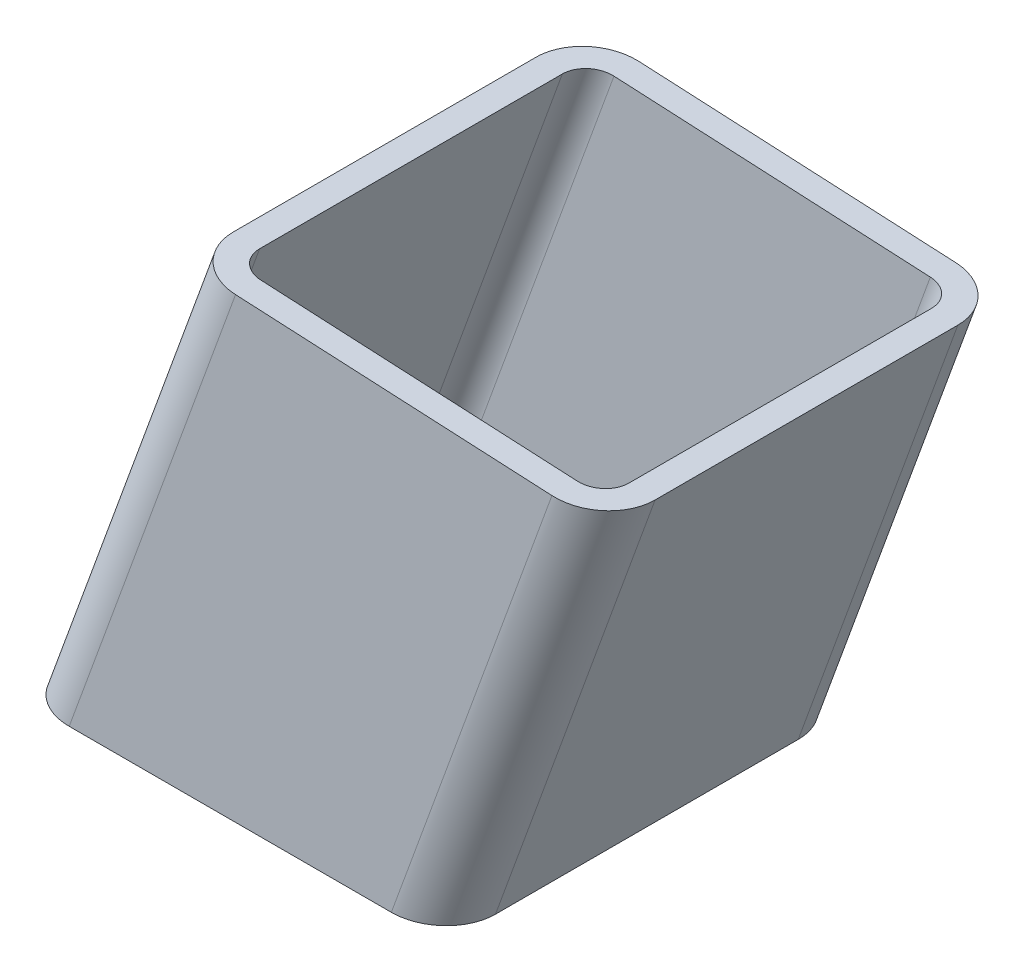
ISO-10303-21;
HEADER;
FILE_DESCRIPTION(('STEP AP214'),'2;1');
FILE_NAME('part.step','',(''),(''),'','','');
FILE_SCHEMA(('AUTOMOTIVE_DESIGN { 1 0 10303 214 1 1 1 1 }'));
ENDSEC;
DATA;
#1=APPLICATION_CONTEXT('core data for automotive mechanical design processes');
#2=APPLICATION_PROTOCOL_DEFINITION('international standard','automotive_design',2000,#1);
#3=PRODUCT_CONTEXT('',#1,'mechanical');
#4=PRODUCT('Part','Part','',(#3));
#5=PRODUCT_RELATED_PRODUCT_CATEGORY('part','',(#4));
#6=PRODUCT_DEFINITION_FORMATION('','',#4);
#7=PRODUCT_DEFINITION_CONTEXT('part definition',#1,'design');
#8=PRODUCT_DEFINITION('design','',#6,#7);
#9=PRODUCT_DEFINITION_SHAPE('','',#8);
#10=(LENGTH_UNIT() NAMED_UNIT(*) SI_UNIT(.MILLI.,.METRE.));
#11=(NAMED_UNIT(*) PLANE_ANGLE_UNIT() SI_UNIT($,.RADIAN.));
#12=(NAMED_UNIT(*) SI_UNIT($,.STERADIAN.) SOLID_ANGLE_UNIT());
#13=UNCERTAINTY_MEASURE_WITH_UNIT(LENGTH_MEASURE(1.E-05),#10,'distance_accuracy_value','');
#14=(GEOMETRIC_REPRESENTATION_CONTEXT(3) GLOBAL_UNCERTAINTY_ASSIGNED_CONTEXT((#13)) GLOBAL_UNIT_ASSIGNED_CONTEXT((#10,
#11,#12)) REPRESENTATION_CONTEXT('',''));
#15=CARTESIAN_POINT('',(0.,0.,0.));
#16=DIRECTION('',(0.,0.,1.));
#17=DIRECTION('',(1.,0.,0.));
#18=AXIS2_PLACEMENT_3D('',#15,#16,#17);
#19=CARTESIAN_POINT('',(4361.60105537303,208.87084615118,30.));
#20=DIRECTION('',(0.939692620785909,-0.342020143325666,0.));
#21=DIRECTION('',(0.342020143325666,0.93969262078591,0.));
#22=AXIS2_PLACEMENT_3D('',#19,#20,#21);
#23=PLANE('',#22);
#24=DIRECTION('',(0.,0.,-1.));
#25=VECTOR('',#24,1.);
#26=CARTESIAN_POINT('',(4306.32458792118,56.9999999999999,29.9999999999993));
#27=LINE('',#26,#25);
#28=CARTESIAN_POINT('',(4306.32458792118,57.0000000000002,30.));
#29=VERTEX_POINT('',#28);
#30=CARTESIAN_POINT('',(4306.32458792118,57.0000000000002,-30.));
#31=VERTEX_POINT('',#30);
#32=EDGE_CURVE('E184',#29,#31,#27,.T.);
#33=ORIENTED_EDGE('',*,*,#32,.F.);
#34=DIRECTION('',(-0.342020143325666,-0.939692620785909,0.));
#35=VECTOR('',#34,1.);
#36=CARTESIAN_POINT('',(4361.60105537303,208.87084615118,30.));
#37=LINE('',#36,#35);
#38=CARTESIAN_POINT('',(4339.48828569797,148.116510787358,30.));
#39=VERTEX_POINT('',#38);
#40=EDGE_CURVE('E217',#39,#29,#37,.T.);
#41=ORIENTED_EDGE('',*,*,#40,.F.);
#42=DIRECTION('',(0.,0.,1.));
#43=VECTOR('',#42,1.);
#44=CARTESIAN_POINT('',(4339.48828569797,148.116510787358,30.));
#45=LINE('',#44,#43);
#46=CARTESIAN_POINT('',(4339.48828569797,148.116510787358,-30.));
#47=VERTEX_POINT('',#46);
#48=EDGE_CURVE('E227',#47,#39,#45,.T.);
#49=ORIENTED_EDGE('',*,*,#48,.F.);
#50=DIRECTION('',(-0.342020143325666,-0.939692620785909,0.));
#51=VECTOR('',#50,1.);
#52=CARTESIAN_POINT('',(4361.60105537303,208.87084615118,-30.));
#53=LINE('',#52,#51);
#54=EDGE_CURVE('E248',#47,#31,#53,.T.);
#55=ORIENTED_EDGE('',*,*,#54,.T.);
#56=EDGE_LOOP('',(#33,#41,#49,#55));
#57=FACE_BOUND('',#56,.T.);
#58=ADVANCED_FACE('F34',(#57),#23,.F.);
#59=CARTESIAN_POINT('',(4370.99798158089,205.450644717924,-30.));
#60=DIRECTION('',(-0.342020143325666,-0.939692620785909,0.));
#61=DIRECTION('',(0.93969262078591,-0.342020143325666,0.));
#62=AXIS2_PLACEMENT_3D('',#59,#60,#61);
#63=CYLINDRICAL_SURFACE('',#62,10.);
#64=CARTESIAN_POINT('',(4316.96636564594,57.0000000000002,-30.));
#65=DIRECTION('',(0.,-1.,0.));
#66=DIRECTION('',(-1.,0.,0.));
#67=AXIS2_PLACEMENT_3D('',#64,#65,#66);
#68=ELLIPSE('',#67,10.6417777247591,10.);
#69=CARTESIAN_POINT('',(4316.96636564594,57.0000000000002,-40.));
#70=VERTEX_POINT('',#69);
#71=EDGE_CURVE('E183',#31,#70,#68,.T.);
#72=ORIENTED_EDGE('',*,*,#71,.F.);
#73=ORIENTED_EDGE('',*,*,#54,.F.);
#74=CARTESIAN_POINT('',(4349.93960510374,147.593230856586,-30.));
#75=DIRECTION('',(0.0500056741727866,0.998748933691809,0.));
#76=DIRECTION('',(-0.998748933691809,0.0500056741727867,0.));
#77=AXIS2_PLACEMENT_3D('',#74,#75,#76);
#78=ELLIPSE('',#77,10.464411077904,10.);
#79=CARTESIAN_POINT('',(4349.93960510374,147.593230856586,-40.));
#80=VERTEX_POINT('',#79);
#81=EDGE_CURVE('E122',#80,#47,#78,.T.);
#82=ORIENTED_EDGE('',*,*,#81,.F.);
#83=DIRECTION('',(-0.342020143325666,-0.939692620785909,0.));
#84=VECTOR('',#83,1.);
#85=CARTESIAN_POINT('',(4370.99798158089,205.450644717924,-40.));
#86=LINE('',#85,#84);
#87=EDGE_CURVE('E245',#80,#70,#86,.T.);
#88=ORIENTED_EDGE('',*,*,#87,.T.);
#89=EDGE_LOOP('',(#72,#73,#82,#88));
#90=FACE_BOUND('',#89,.T.);
#91=ADVANCED_FACE('F308',(#90),#63,.T.);
#92=CARTESIAN_POINT('',(4427.37953882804,184.929436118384,-40.));
#93=DIRECTION('',(0.,0.,1.));
#94=DIRECTION('',(1.,0.,0.));
#95=AXIS2_PLACEMENT_3D('',#92,#93,#94);
#96=PLANE('',#95);
#97=DIRECTION('',(1.,0.,0.));
#98=VECTOR('',#97,1.);
#99=CARTESIAN_POINT('',(4427.37953882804,57.0000000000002,-40.));
#100=LINE('',#99,#98);
#101=CARTESIAN_POINT('',(4380.81703199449,57.0000000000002,-40.));
#102=VERTEX_POINT('',#101);
#103=EDGE_CURVE('E181',#70,#102,#100,.T.);
#104=ORIENTED_EDGE('',*,*,#103,.F.);
#105=ORIENTED_EDGE('',*,*,#87,.F.);
#106=DIRECTION('',(-0.998748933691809,0.0500056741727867,0.));
#107=VECTOR('',#106,1.);
#108=CARTESIAN_POINT('',(4425.32120870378,143.819001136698,-40.));
#109=LINE('',#108,#107);
#110=CARTESIAN_POINT('',(4412.64752153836,144.453551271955,-40.));
#111=VERTEX_POINT('',#110);
#112=EDGE_CURVE('E118',#111,#80,#109,.T.);
#113=ORIENTED_EDGE('',*,*,#112,.F.);
#114=DIRECTION('',(-0.342020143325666,-0.939692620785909,0.));
#115=VECTOR('',#114,1.);
#116=CARTESIAN_POINT('',(4427.37953882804,184.929436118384,-40.));
#117=LINE('',#116,#115);
#118=EDGE_CURVE('E242',#111,#102,#117,.T.);
#119=ORIENTED_EDGE('',*,*,#118,.T.);
#120=EDGE_LOOP('',(#104,#105,#113,#119));
#121=FACE_BOUND('',#120,.T.);
#122=ADVANCED_FACE('F306',(#121),#96,.F.);
#123=CARTESIAN_POINT('',(4427.37953882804,184.929436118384,-30.));
#124=DIRECTION('',(-0.342020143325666,-0.939692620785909,0.));
#125=DIRECTION('',(0.93969262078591,-0.342020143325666,0.));
#126=AXIS2_PLACEMENT_3D('',#123,#124,#125);
#127=CYLINDRICAL_SURFACE('',#126,10.);
#128=CARTESIAN_POINT('',(4380.81703199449,57.0000000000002,-30.));
#129=DIRECTION('',(0.,-1.,0.));
#130=DIRECTION('',(-1.,0.,0.));
#131=AXIS2_PLACEMENT_3D('',#128,#129,#130);
#132=ELLIPSE('',#131,10.6417777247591,10.);
#133=CARTESIAN_POINT('',(4391.45880971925,57.0000000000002,-30.));
#134=VERTEX_POINT('',#133);
#135=EDGE_CURVE('E179',#102,#134,#132,.T.);
#136=ORIENTED_EDGE('',*,*,#135,.F.);
#137=ORIENTED_EDGE('',*,*,#118,.F.);
#138=CARTESIAN_POINT('',(4412.64752153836,144.453551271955,-30.));
#139=DIRECTION('',(0.0500056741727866,0.998748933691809,0.));
#140=DIRECTION('',(-0.998748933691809,0.0500056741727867,0.));
#141=AXIS2_PLACEMENT_3D('',#138,#139,#140);
#142=ELLIPSE('',#141,10.4644110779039,10.);
#143=CARTESIAN_POINT('',(4423.09884094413,143.930271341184,-30.));
#144=VERTEX_POINT('',#143);
#145=EDGE_CURVE('E223',#144,#111,#142,.T.);
#146=ORIENTED_EDGE('',*,*,#145,.F.);
#147=DIRECTION('',(-0.342020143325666,-0.939692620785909,0.));
#148=VECTOR('',#147,1.);
#149=CARTESIAN_POINT('',(4436.7764650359,181.509234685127,-30.));
#150=LINE('',#149,#148);
#151=EDGE_CURVE('E239',#144,#134,#150,.T.);
#152=ORIENTED_EDGE('',*,*,#151,.T.);
#153=EDGE_LOOP('',(#136,#137,#146,#152));
#154=FACE_BOUND('',#153,.T.);
#155=ADVANCED_FACE('F301',(#154),#127,.T.);
#156=CARTESIAN_POINT('',(4436.7764650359,181.509234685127,-30.));
#157=DIRECTION('',(-0.939692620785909,0.342020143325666,0.));
#158=DIRECTION('',(-0.342020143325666,-0.93969262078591,0.));
#159=AXIS2_PLACEMENT_3D('',#156,#157,#158);
#160=PLANE('',#159);
#161=DIRECTION('',(0.,0.,1.));
#162=VECTOR('',#161,1.);
#163=CARTESIAN_POINT('',(4391.45880971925,57.0000000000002,-30.0000000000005));
#164=LINE('',#163,#162);
#165=CARTESIAN_POINT('',(4391.45880971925,56.9999999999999,30.));
#166=VERTEX_POINT('',#165);
#167=EDGE_CURVE('E173',#134,#166,#164,.T.);
#168=ORIENTED_EDGE('',*,*,#167,.F.);
#169=ORIENTED_EDGE('',*,*,#151,.F.);
#170=DIRECTION('',(0.,0.,-1.));
#171=VECTOR('',#170,1.);
#172=CARTESIAN_POINT('',(4423.09884094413,143.930271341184,-30.));
#173=LINE('',#172,#171);
#174=CARTESIAN_POINT('',(4423.09884094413,143.930271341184,30.));
#175=VERTEX_POINT('',#174);
#176=EDGE_CURVE('E221',#175,#144,#173,.T.);
#177=ORIENTED_EDGE('',*,*,#176,.F.);
#178=DIRECTION('',(-0.342020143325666,-0.939692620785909,0.));
#179=VECTOR('',#178,1.);
#180=CARTESIAN_POINT('',(4436.7764650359,181.509234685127,30.));
#181=LINE('',#180,#179);
#182=EDGE_CURVE('E236',#175,#166,#181,.T.);
#183=ORIENTED_EDGE('',*,*,#182,.T.);
#184=EDGE_LOOP('',(#168,#169,#177,#183));
#185=FACE_BOUND('',#184,.T.);
#186=ADVANCED_FACE('F298',(#185),#160,.F.);
#187=CARTESIAN_POINT('',(4427.37953882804,184.929436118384,30.));
#188=DIRECTION('',(-0.342020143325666,-0.939692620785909,0.));
#189=DIRECTION('',(0.93969262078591,-0.342020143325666,0.));
#190=AXIS2_PLACEMENT_3D('',#187,#188,#189);
#191=CYLINDRICAL_SURFACE('',#190,10.);
#192=CARTESIAN_POINT('',(4380.81703199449,56.9999999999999,30.));
#193=DIRECTION('',(0.,-1.,0.));
#194=DIRECTION('',(-1.,0.,0.));
#195=AXIS2_PLACEMENT_3D('',#192,#193,#194);
#196=ELLIPSE('',#195,10.6417777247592,10.);
#197=CARTESIAN_POINT('',(4380.81703199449,56.9999999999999,40.));
#198=VERTEX_POINT('',#197);
#199=EDGE_CURVE('E171',#166,#198,#196,.T.);
#200=ORIENTED_EDGE('',*,*,#199,.F.);
#201=ORIENTED_EDGE('',*,*,#182,.F.);
#202=CARTESIAN_POINT('',(4412.64752153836,144.453551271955,30.));
#203=DIRECTION('',(0.0500056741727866,0.998748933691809,0.));
#204=DIRECTION('',(-0.998748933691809,0.0500056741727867,0.));
#205=AXIS2_PLACEMENT_3D('',#202,#203,#204);
#206=ELLIPSE('',#205,10.464411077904,10.);
#207=CARTESIAN_POINT('',(4412.64752153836,144.453551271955,40.));
#208=VERTEX_POINT('',#207);
#209=EDGE_CURVE('E219',#208,#175,#206,.T.);
#210=ORIENTED_EDGE('',*,*,#209,.F.);
#211=DIRECTION('',(-0.342020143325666,-0.939692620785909,0.));
#212=VECTOR('',#211,1.);
#213=CARTESIAN_POINT('',(4427.37953882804,184.929436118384,40.));
#214=LINE('',#213,#212);
#215=EDGE_CURVE('E233',#208,#198,#214,.T.);
#216=ORIENTED_EDGE('',*,*,#215,.T.);
#217=EDGE_LOOP('',(#200,#201,#210,#216));
#218=FACE_BOUND('',#217,.T.);
#219=ADVANCED_FACE('F291',(#218),#191,.T.);
#220=CARTESIAN_POINT('',(4370.99798158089,205.450644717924,40.));
#221=DIRECTION('',(0.,0.,-1.));
#222=DIRECTION('',(-1.,0.,0.));
#223=AXIS2_PLACEMENT_3D('',#220,#221,#222);
#224=PLANE('',#223);
#225=DIRECTION('',(-1.,0.,0.));
#226=VECTOR('',#225,1.);
#227=CARTESIAN_POINT('',(4370.99798158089,56.9999999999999,40.));
#228=LINE('',#227,#226);
#229=CARTESIAN_POINT('',(4316.96636564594,56.9999999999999,40.));
#230=VERTEX_POINT('',#229);
#231=EDGE_CURVE('E53',#198,#230,#228,.T.);
#232=ORIENTED_EDGE('',*,*,#231,.F.);
#233=ORIENTED_EDGE('',*,*,#215,.F.);
#234=DIRECTION('',(0.998748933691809,-0.0500056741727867,0.));
#235=VECTOR('',#234,1.);
#236=CARTESIAN_POINT('',(4368.05574428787,146.686186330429,40.));
#237=LINE('',#236,#235);
#238=CARTESIAN_POINT('',(4349.93960510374,147.593230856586,40.));
#239=VERTEX_POINT('',#238);
#240=EDGE_CURVE('E216',#239,#208,#237,.T.);
#241=ORIENTED_EDGE('',*,*,#240,.F.);
#242=DIRECTION('',(-0.342020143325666,-0.939692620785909,0.));
#243=VECTOR('',#242,1.);
#244=CARTESIAN_POINT('',(4370.99798158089,205.450644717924,40.));
#245=LINE('',#244,#243);
#246=EDGE_CURVE('E230',#239,#230,#245,.T.);
#247=ORIENTED_EDGE('',*,*,#246,.T.);
#248=EDGE_LOOP('',(#232,#233,#241,#247));
#249=FACE_BOUND('',#248,.T.);
#250=ADVANCED_FACE('F288',(#249),#224,.F.);
#251=CARTESIAN_POINT('',(4370.99798158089,205.450644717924,30.));
#252=DIRECTION('',(-0.342020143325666,-0.939692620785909,0.));
#253=DIRECTION('',(0.93969262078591,-0.342020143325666,0.));
#254=AXIS2_PLACEMENT_3D('',#251,#252,#253);
#255=CYLINDRICAL_SURFACE('',#254,10.);
#256=CARTESIAN_POINT('',(4316.96636564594,56.9999999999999,30.));
#257=DIRECTION('',(0.,-1.,0.));
#258=DIRECTION('',(-1.,0.,0.));
#259=AXIS2_PLACEMENT_3D('',#256,#257,#258);
#260=ELLIPSE('',#259,10.6417777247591,10.);
#261=EDGE_CURVE('E176',#230,#29,#260,.T.);
#262=ORIENTED_EDGE('',*,*,#261,.F.);
#263=ORIENTED_EDGE('',*,*,#246,.F.);
#264=CARTESIAN_POINT('',(4349.93960510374,147.593230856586,30.));
#265=DIRECTION('',(0.0500056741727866,0.998748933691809,0.));
#266=DIRECTION('',(-0.998748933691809,0.0500056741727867,0.));
#267=AXIS2_PLACEMENT_3D('',#264,#265,#266);
#268=ELLIPSE('',#267,10.464411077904,10.);
#269=EDGE_CURVE('E214',#39,#239,#268,.T.);
#270=ORIENTED_EDGE('',*,*,#269,.F.);
#271=ORIENTED_EDGE('',*,*,#40,.T.);
#272=EDGE_LOOP('',(#262,#263,#270,#271));
#273=FACE_BOUND('',#272,.T.);
#274=ADVANCED_FACE('F36',(#273),#255,.T.);
#275=CARTESIAN_POINT('',(6158.08276398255,57.0625533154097,-40.));
#276=DIRECTION('',(0.0500056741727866,0.998748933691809,0.));
#277=DIRECTION('',(-0.998748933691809,0.0500056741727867,0.));
#278=AXIS2_PLACEMENT_3D('',#275,#276,#277);
#279=PLANE('',#278);
#280=DIRECTION('',(0.998748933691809,-0.0500056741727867,0.));
#281=VECTOR('',#280,1.);
#282=CARTESIAN_POINT('',(4368.05574428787,146.686186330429,35.));
#283=LINE('',#282,#281);
#284=CARTESIAN_POINT('',(4349.93960510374,147.593230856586,35.));
#285=VERTEX_POINT('',#284);
#286=CARTESIAN_POINT('',(4412.64752153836,144.453551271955,35.));
#287=VERTEX_POINT('',#286);
#288=EDGE_CURVE('E186',#285,#287,#283,.T.);
#289=ORIENTED_EDGE('',*,*,#288,.F.);
#290=CARTESIAN_POINT('',(4349.93960510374,147.593230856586,30.));
#291=DIRECTION('',(0.0500056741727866,0.998748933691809,0.));
#292=DIRECTION('',(-0.998748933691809,0.0500056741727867,0.));
#293=AXIS2_PLACEMENT_3D('',#290,#291,#292);
#294=ELLIPSE('',#293,5.23220553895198,5.00000000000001);
#295=CARTESIAN_POINT('',(4344.71394540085,147.854870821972,30.));
#296=VERTEX_POINT('',#295);
#297=EDGE_CURVE('E191',#296,#285,#294,.T.);
#298=ORIENTED_EDGE('',*,*,#297,.F.);
#299=DIRECTION('',(0.,0.,1.));
#300=VECTOR('',#299,1.);
#301=CARTESIAN_POINT('',(4344.71394540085,147.854870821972,30.));
#302=LINE('',#301,#300);
#303=CARTESIAN_POINT('',(4344.71394540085,147.854870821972,-30.));
#304=VERTEX_POINT('',#303);
#305=EDGE_CURVE('E196',#304,#296,#302,.T.);
#306=ORIENTED_EDGE('',*,*,#305,.F.);
#307=CARTESIAN_POINT('',(4349.93960510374,147.593230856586,-30.));
#308=DIRECTION('',(0.0500056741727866,0.998748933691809,0.));
#309=DIRECTION('',(-0.998748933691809,0.0500056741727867,0.));
#310=AXIS2_PLACEMENT_3D('',#307,#308,#309);
#311=ELLIPSE('',#310,5.23220553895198,5.00000000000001);
#312=CARTESIAN_POINT('',(4349.93960510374,147.593230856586,-35.));
#313=VERTEX_POINT('',#312);
#314=EDGE_CURVE('E201',#313,#304,#311,.T.);
#315=ORIENTED_EDGE('',*,*,#314,.F.);
#316=DIRECTION('',(-0.998748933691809,0.0500056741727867,0.));
#317=VECTOR('',#316,1.);
#318=CARTESIAN_POINT('',(4425.32120870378,143.819001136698,-35.));
#319=LINE('',#318,#317);
#320=CARTESIAN_POINT('',(4412.64752153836,144.453551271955,-35.));
#321=VERTEX_POINT('',#320);
#322=EDGE_CURVE('E206',#321,#313,#319,.T.);
#323=ORIENTED_EDGE('',*,*,#322,.F.);
#324=CARTESIAN_POINT('',(4412.64752153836,144.453551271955,-30.));
#325=DIRECTION('',(0.0500056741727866,0.998748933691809,0.));
#326=DIRECTION('',(-0.998748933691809,0.0500056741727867,0.));
#327=AXIS2_PLACEMENT_3D('',#324,#325,#326);
#328=ELLIPSE('',#327,5.23220553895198,5.00000000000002);
#329=CARTESIAN_POINT('',(4417.87318124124,144.19191130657,-30.));
#330=VERTEX_POINT('',#329);
#331=EDGE_CURVE('E167',#330,#321,#328,.T.);
#332=ORIENTED_EDGE('',*,*,#331,.F.);
#333=DIRECTION('',(0.,0.,-1.));
#334=VECTOR('',#333,1.);
#335=CARTESIAN_POINT('',(4417.87318124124,144.191911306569,-30.));
#336=LINE('',#335,#334);
#337=CARTESIAN_POINT('',(4417.87318124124,144.191911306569,30.));
#338=VERTEX_POINT('',#337);
#339=EDGE_CURVE('E158',#338,#330,#336,.T.);
#340=ORIENTED_EDGE('',*,*,#339,.F.);
#341=CARTESIAN_POINT('',(4412.64752153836,144.453551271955,30.));
#342=DIRECTION('',(0.0500056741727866,0.998748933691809,0.));
#343=DIRECTION('',(-0.998748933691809,0.0500056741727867,0.));
#344=AXIS2_PLACEMENT_3D('',#341,#342,#343);
#345=ELLIPSE('',#344,5.23220553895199,5.00000000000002);
#346=EDGE_CURVE('E11',#287,#338,#345,.T.);
#347=ORIENTED_EDGE('',*,*,#346,.F.);
#348=EDGE_LOOP('',(#289,#298,#306,#315,#323,#332,#340,#347));
#349=FACE_BOUND('',#348,.T.);
#350=ORIENTED_EDGE('',*,*,#269,.T.);
#351=ORIENTED_EDGE('',*,*,#240,.T.);
#352=ORIENTED_EDGE('',*,*,#209,.T.);
#353=ORIENTED_EDGE('',*,*,#176,.T.);
#354=ORIENTED_EDGE('',*,*,#145,.T.);
#355=ORIENTED_EDGE('',*,*,#112,.T.);
#356=ORIENTED_EDGE('',*,*,#81,.T.);
#357=ORIENTED_EDGE('',*,*,#48,.T.);
#358=EDGE_LOOP('',(#350,#351,#352,#353,#354,#355,#356,#357));
#359=FACE_BOUND('',#358,.T.);
#360=ADVANCED_FACE('F284',(#349,#359),#279,.T.);
#361=CARTESIAN_POINT('',(9149.96897120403,57.0000000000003,-59.9999999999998));
#362=DIRECTION('',(0.,-1.,0.));
#363=DIRECTION('',(0.,0.,-1.));
#364=AXIS2_PLACEMENT_3D('',#361,#362,#363);
#365=PLANE('',#364);
#366=DIRECTION('',(0.,0.,1.));
#367=VECTOR('',#366,1.);
#368=CARTESIAN_POINT('',(4386.13792085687,57.0000000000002,-30.0000000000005));
#369=LINE('',#368,#367);
#370=CARTESIAN_POINT('',(4386.13792085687,57.0000000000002,-30.));
#371=VERTEX_POINT('',#370);
#372=CARTESIAN_POINT('',(4386.13792085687,57.,30.));
#373=VERTEX_POINT('',#372);
#374=EDGE_CURVE('E151',#371,#373,#369,.T.);
#375=ORIENTED_EDGE('',*,*,#374,.F.);
#376=CARTESIAN_POINT('',(4380.81703199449,57.0000000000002,-30.));
#377=DIRECTION('',(0.,-1.,0.));
#378=DIRECTION('',(-1.,0.,0.));
#379=AXIS2_PLACEMENT_3D('',#376,#377,#378);
#380=ELLIPSE('',#379,5.32088886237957,5.00000000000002);
#381=CARTESIAN_POINT('',(4380.81703199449,57.0000000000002,-35.));
#382=VERTEX_POINT('',#381);
#383=EDGE_CURVE('E147',#382,#371,#380,.T.);
#384=ORIENTED_EDGE('',*,*,#383,.F.);
#385=DIRECTION('',(1.,0.,0.));
#386=VECTOR('',#385,1.);
#387=CARTESIAN_POINT('',(4427.37953882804,57.0000000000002,-35.));
#388=LINE('',#387,#386);
#389=CARTESIAN_POINT('',(4316.96636564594,57.0000000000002,-35.));
#390=VERTEX_POINT('',#389);
#391=EDGE_CURVE('E210',#390,#382,#388,.T.);
#392=ORIENTED_EDGE('',*,*,#391,.F.);
#393=CARTESIAN_POINT('',(4316.96636564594,57.0000000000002,-30.));
#394=DIRECTION('',(0.,-1.,0.));
#395=DIRECTION('',(-1.,0.,0.));
#396=AXIS2_PLACEMENT_3D('',#393,#394,#395);
#397=ELLIPSE('',#396,5.32088886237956,5.00000000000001);
#398=CARTESIAN_POINT('',(4311.64547678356,57.0000000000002,-30.));
#399=VERTEX_POINT('',#398);
#400=EDGE_CURVE('E205',#399,#390,#397,.T.);
#401=ORIENTED_EDGE('',*,*,#400,.F.);
#402=DIRECTION('',(0.,0.,-1.));
#403=VECTOR('',#402,1.);
#404=CARTESIAN_POINT('',(4311.64547678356,56.9999999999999,29.9999999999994));
#405=LINE('',#404,#403);
#406=CARTESIAN_POINT('',(4311.64547678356,56.9999999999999,30.));
#407=VERTEX_POINT('',#406);
#408=EDGE_CURVE('E200',#407,#399,#405,.T.);
#409=ORIENTED_EDGE('',*,*,#408,.F.);
#410=CARTESIAN_POINT('',(4316.96636564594,56.9999999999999,30.));
#411=DIRECTION('',(0.,-1.,0.));
#412=DIRECTION('',(-1.,0.,0.));
#413=AXIS2_PLACEMENT_3D('',#410,#411,#412);
#414=ELLIPSE('',#413,5.32088886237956,5.00000000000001);
#415=CARTESIAN_POINT('',(4316.96636564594,56.9999999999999,35.));
#416=VERTEX_POINT('',#415);
#417=EDGE_CURVE('E195',#416,#407,#414,.T.);
#418=ORIENTED_EDGE('',*,*,#417,.F.);
#419=DIRECTION('',(-1.,0.,0.));
#420=VECTOR('',#419,1.);
#421=CARTESIAN_POINT('',(4370.99798158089,56.9999999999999,35.));
#422=LINE('',#421,#420);
#423=CARTESIAN_POINT('',(4380.81703199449,56.9999999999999,35.));
#424=VERTEX_POINT('',#423);
#425=EDGE_CURVE('E190',#424,#416,#422,.T.);
#426=ORIENTED_EDGE('',*,*,#425,.F.);
#427=CARTESIAN_POINT('',(4380.81703199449,56.9999999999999,30.));
#428=DIRECTION('',(0.,-1.,0.));
#429=DIRECTION('',(-1.,0.,0.));
#430=AXIS2_PLACEMENT_3D('',#427,#428,#429);
#431=ELLIPSE('',#430,5.32088886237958,5.00000000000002);
#432=EDGE_CURVE('E44',#373,#424,#431,.T.);
#433=ORIENTED_EDGE('',*,*,#432,.F.);
#434=EDGE_LOOP('',(#375,#384,#392,#401,#409,#418,#426,#433));
#435=FACE_BOUND('',#434,.T.);
#436=ORIENTED_EDGE('',*,*,#261,.T.);
#437=ORIENTED_EDGE('',*,*,#32,.T.);
#438=ORIENTED_EDGE('',*,*,#71,.T.);
#439=ORIENTED_EDGE('',*,*,#103,.T.);
#440=ORIENTED_EDGE('',*,*,#135,.T.);
#441=ORIENTED_EDGE('',*,*,#167,.T.);
#442=ORIENTED_EDGE('',*,*,#199,.T.);
#443=ORIENTED_EDGE('',*,*,#231,.T.);
#444=EDGE_LOOP('',(#436,#437,#438,#439,#440,#441,#442,#443));
#445=FACE_BOUND('',#444,.T.);
#446=ADVANCED_FACE('F152',(#435,#445),#365,.T.);
#447=CARTESIAN_POINT('',(4432.07800193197,183.219335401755,-30.));
#448=DIRECTION('',(-0.939692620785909,0.342020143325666,0.));
#449=DIRECTION('',(-0.342020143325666,-0.93969262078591,0.));
#450=AXIS2_PLACEMENT_3D('',#447,#448,#449);
#451=PLANE('',#450);
#452=DIRECTION('',(-0.342020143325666,-0.939692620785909,0.));
#453=VECTOR('',#452,1.);
#454=CARTESIAN_POINT('',(4432.07800193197,183.219335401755,-30.));
#455=LINE('',#454,#453);
#456=EDGE_CURVE('E38',#330,#371,#455,.T.);
#457=ORIENTED_EDGE('',*,*,#456,.T.);
#458=ORIENTED_EDGE('',*,*,#374,.T.);
#459=DIRECTION('',(-0.342020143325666,-0.939692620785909,0.));
#460=VECTOR('',#459,1.);
#461=CARTESIAN_POINT('',(4432.07800193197,183.219335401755,30.));
#462=LINE('',#461,#460);
#463=EDGE_CURVE('E189',#338,#373,#462,.T.);
#464=ORIENTED_EDGE('',*,*,#463,.F.);
#465=ORIENTED_EDGE('',*,*,#339,.T.);
#466=EDGE_LOOP('',(#457,#458,#464,#465));
#467=FACE_BOUND('',#466,.T.);
#468=ADVANCED_FACE('F170',(#467),#451,.T.);
#469=CARTESIAN_POINT('',(4427.37953882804,184.929436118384,-30.));
#470=DIRECTION('',(-0.342020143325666,-0.939692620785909,0.));
#471=DIRECTION('',(0.93969262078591,-0.342020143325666,0.));
#472=AXIS2_PLACEMENT_3D('',#469,#470,#471);
#473=CYLINDRICAL_SURFACE('',#472,5.00000000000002);
#474=DIRECTION('',(-0.342020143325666,-0.939692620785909,0.));
#475=VECTOR('',#474,1.);
#476=CARTESIAN_POINT('',(4427.37953882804,184.929436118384,-35.));
#477=LINE('',#476,#475);
#478=EDGE_CURVE('E166',#321,#382,#477,.T.);
#479=ORIENTED_EDGE('',*,*,#478,.T.);
#480=ORIENTED_EDGE('',*,*,#383,.T.);
#481=ORIENTED_EDGE('',*,*,#456,.F.);
#482=ORIENTED_EDGE('',*,*,#331,.T.);
#483=EDGE_LOOP('',(#479,#480,#481,#482));
#484=FACE_BOUND('',#483,.T.);
#485=ADVANCED_FACE('F163',(#484),#473,.F.);
#486=CARTESIAN_POINT('',(4427.37953882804,184.929436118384,-35.));
#487=DIRECTION('',(0.,0.,1.));
#488=DIRECTION('',(1.,0.,0.));
#489=AXIS2_PLACEMENT_3D('',#486,#487,#488);
#490=PLANE('',#489);
#491=DIRECTION('',(-0.342020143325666,-0.939692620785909,0.));
#492=VECTOR('',#491,1.);
#493=CARTESIAN_POINT('',(4370.99798158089,205.450644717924,-35.));
#494=LINE('',#493,#492);
#495=EDGE_CURVE('E212',#313,#390,#494,.T.);
#496=ORIENTED_EDGE('',*,*,#495,.T.);
#497=ORIENTED_EDGE('',*,*,#391,.T.);
#498=ORIENTED_EDGE('',*,*,#478,.F.);
#499=ORIENTED_EDGE('',*,*,#322,.T.);
#500=EDGE_LOOP('',(#496,#497,#498,#499));
#501=FACE_BOUND('',#500,.T.);
#502=ADVANCED_FACE('F342',(#501),#490,.T.);
#503=CARTESIAN_POINT('',(4370.99798158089,205.450644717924,-30.));
#504=DIRECTION('',(-0.342020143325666,-0.939692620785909,0.));
#505=DIRECTION('',(0.93969262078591,-0.342020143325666,0.));
#506=AXIS2_PLACEMENT_3D('',#503,#504,#505);
#507=CYLINDRICAL_SURFACE('',#506,5.00000000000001);
#508=DIRECTION('',(-0.342020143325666,-0.939692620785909,0.));
#509=VECTOR('',#508,1.);
#510=CARTESIAN_POINT('',(4366.29951847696,207.160745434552,-30.));
#511=LINE('',#510,#509);
#512=EDGE_CURVE('E209',#304,#399,#511,.T.);
#513=ORIENTED_EDGE('',*,*,#512,.T.);
#514=ORIENTED_EDGE('',*,*,#400,.T.);
#515=ORIENTED_EDGE('',*,*,#495,.F.);
#516=ORIENTED_EDGE('',*,*,#314,.T.);
#517=EDGE_LOOP('',(#513,#514,#515,#516));
#518=FACE_BOUND('',#517,.T.);
#519=ADVANCED_FACE('F345',(#518),#507,.F.);
#520=CARTESIAN_POINT('',(4366.29951847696,207.160745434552,30.));
#521=DIRECTION('',(0.939692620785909,-0.342020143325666,0.));
#522=DIRECTION('',(0.342020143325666,0.93969262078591,0.));
#523=AXIS2_PLACEMENT_3D('',#520,#521,#522);
#524=PLANE('',#523);
#525=DIRECTION('',(-0.342020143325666,-0.939692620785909,0.));
#526=VECTOR('',#525,1.);
#527=CARTESIAN_POINT('',(4366.29951847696,207.160745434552,30.));
#528=LINE('',#527,#526);
#529=EDGE_CURVE('E204',#296,#407,#528,.T.);
#530=ORIENTED_EDGE('',*,*,#529,.T.);
#531=ORIENTED_EDGE('',*,*,#408,.T.);
#532=ORIENTED_EDGE('',*,*,#512,.F.);
#533=ORIENTED_EDGE('',*,*,#305,.T.);
#534=EDGE_LOOP('',(#530,#531,#532,#533));
#535=FACE_BOUND('',#534,.T.);
#536=ADVANCED_FACE('F348',(#535),#524,.T.);
#537=CARTESIAN_POINT('',(4370.99798158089,205.450644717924,30.));
#538=DIRECTION('',(-0.342020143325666,-0.939692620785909,0.));
#539=DIRECTION('',(0.93969262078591,-0.342020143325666,0.));
#540=AXIS2_PLACEMENT_3D('',#537,#538,#539);
#541=CYLINDRICAL_SURFACE('',#540,5.00000000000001);
#542=DIRECTION('',(-0.342020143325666,-0.939692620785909,0.));
#543=VECTOR('',#542,1.);
#544=CARTESIAN_POINT('',(4370.99798158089,205.450644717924,35.));
#545=LINE('',#544,#543);
#546=EDGE_CURVE('E199',#285,#416,#545,.T.);
#547=ORIENTED_EDGE('',*,*,#546,.T.);
#548=ORIENTED_EDGE('',*,*,#417,.T.);
#549=ORIENTED_EDGE('',*,*,#529,.F.);
#550=ORIENTED_EDGE('',*,*,#297,.T.);
#551=EDGE_LOOP('',(#547,#548,#549,#550));
#552=FACE_BOUND('',#551,.T.);
#553=ADVANCED_FACE('F352',(#552),#541,.F.);
#554=CARTESIAN_POINT('',(4370.99798158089,205.450644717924,35.));
#555=DIRECTION('',(0.,0.,-1.));
#556=DIRECTION('',(-1.,0.,0.));
#557=AXIS2_PLACEMENT_3D('',#554,#555,#556);
#558=PLANE('',#557);
#559=DIRECTION('',(-0.342020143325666,-0.939692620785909,0.));
#560=VECTOR('',#559,1.);
#561=CARTESIAN_POINT('',(4427.37953882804,184.929436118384,35.));
#562=LINE('',#561,#560);
#563=EDGE_CURVE('E194',#287,#424,#562,.T.);
#564=ORIENTED_EDGE('',*,*,#563,.T.);
#565=ORIENTED_EDGE('',*,*,#425,.T.);
#566=ORIENTED_EDGE('',*,*,#546,.F.);
#567=ORIENTED_EDGE('',*,*,#288,.T.);
#568=EDGE_LOOP('',(#564,#565,#566,#567));
#569=FACE_BOUND('',#568,.T.);
#570=ADVANCED_FACE('F356',(#569),#558,.T.);
#571=CARTESIAN_POINT('',(4427.37953882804,184.929436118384,30.));
#572=DIRECTION('',(-0.342020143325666,-0.939692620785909,0.));
#573=DIRECTION('',(0.93969262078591,-0.342020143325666,0.));
#574=AXIS2_PLACEMENT_3D('',#571,#572,#573);
#575=CYLINDRICAL_SURFACE('',#574,5.00000000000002);
#576=ORIENTED_EDGE('',*,*,#463,.T.);
#577=ORIENTED_EDGE('',*,*,#432,.T.);
#578=ORIENTED_EDGE('',*,*,#563,.F.);
#579=ORIENTED_EDGE('',*,*,#346,.T.);
#580=EDGE_LOOP('',(#576,#577,#578,#579));
#581=FACE_BOUND('',#580,.T.);
#582=ADVANCED_FACE('F359',(#581),#575,.F.);
#583=CLOSED_SHELL('',(#58,#91,#122,#155,#186,#219,#250,#274,#360,#446,#468,#485,#502,#519,#536,
#553,#570,#582));
#584=MANIFOLD_SOLID_BREP('B2',#583);
#585=ADVANCED_BREP_SHAPE_REPRESENTATION('',(#18,#584),#14);
#586=SHAPE_DEFINITION_REPRESENTATION(#9,#585);
ENDSEC;
END-ISO-10303-21;
